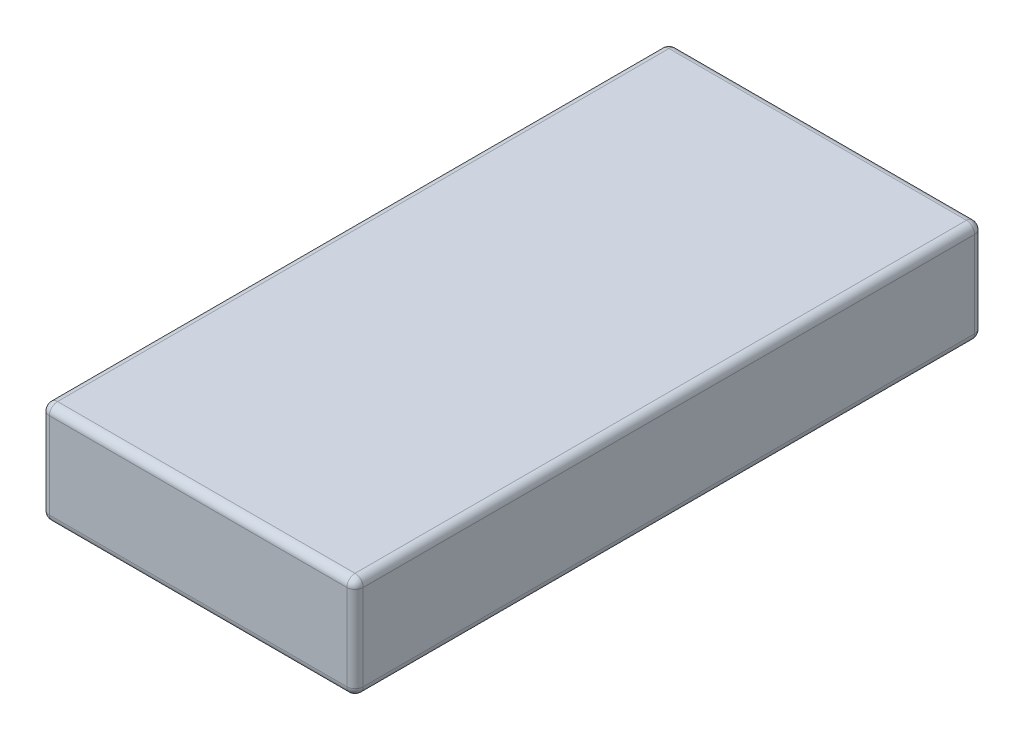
ISO-10303-21;
HEADER;
FILE_DESCRIPTION(('STEP AP214'),'2;1');
FILE_NAME('part.step','',(''),(''),'','','');
FILE_SCHEMA(('AUTOMOTIVE_DESIGN { 1 0 10303 214 1 1 1 1 }'));
ENDSEC;
DATA;
#1=APPLICATION_CONTEXT('core data for automotive mechanical design processes');
#2=APPLICATION_PROTOCOL_DEFINITION('international standard','automotive_design',2000,#1);
#3=PRODUCT_CONTEXT('',#1,'mechanical');
#4=PRODUCT('Part','Part','',(#3));
#5=PRODUCT_RELATED_PRODUCT_CATEGORY('part','',(#4));
#6=PRODUCT_DEFINITION_FORMATION('','',#4);
#7=PRODUCT_DEFINITION_CONTEXT('part definition',#1,'design');
#8=PRODUCT_DEFINITION('design','',#6,#7);
#9=PRODUCT_DEFINITION_SHAPE('','',#8);
#10=(LENGTH_UNIT() NAMED_UNIT(*) SI_UNIT(.MILLI.,.METRE.));
#11=(NAMED_UNIT(*) PLANE_ANGLE_UNIT() SI_UNIT($,.RADIAN.));
#12=(NAMED_UNIT(*) SI_UNIT($,.STERADIAN.) SOLID_ANGLE_UNIT());
#13=UNCERTAINTY_MEASURE_WITH_UNIT(LENGTH_MEASURE(1.E-05),#10,'distance_accuracy_value','');
#14=(GEOMETRIC_REPRESENTATION_CONTEXT(3) GLOBAL_UNCERTAINTY_ASSIGNED_CONTEXT((#13)) GLOBAL_UNIT_ASSIGNED_CONTEXT((#10,
#11,#12)) REPRESENTATION_CONTEXT('',''));
#15=CARTESIAN_POINT('',(0.,0.,0.));
#16=DIRECTION('',(0.,0.,1.));
#17=DIRECTION('',(1.,0.,0.));
#18=AXIS2_PLACEMENT_3D('',#15,#16,#17);
#19=CARTESIAN_POINT('',(57.5,18.75,115.));
#20=DIRECTION('',(-1.,0.,0.));
#21=DIRECTION('',(0.,0.,1.));
#22=AXIS2_PLACEMENT_3D('',#19,#20,#21);
#23=PLANE('',#22);
#24=DIRECTION('',(0.,1.,0.));
#25=VECTOR('',#24,1.);
#26=CARTESIAN_POINT('',(57.5,-18.75,112.));
#27=LINE('',#26,#25);
#28=CARTESIAN_POINT('',(57.5,15.75,112.));
#29=VERTEX_POINT('',#28);
#30=CARTESIAN_POINT('',(57.5,-15.75,112.));
#31=VERTEX_POINT('',#30);
#32=EDGE_CURVE('E221',#29,#31,#27,.F.);
#33=ORIENTED_EDGE('',*,*,#32,.T.);
#34=DIRECTION('',(0.,0.,-1.));
#35=VECTOR('',#34,1.);
#36=CARTESIAN_POINT('',(57.5,-15.75,115.));
#37=LINE('',#36,#35);
#38=CARTESIAN_POINT('',(57.5,-15.75,-112.));
#39=VERTEX_POINT('',#38);
#40=EDGE_CURVE('E224',#31,#39,#37,.T.);
#41=ORIENTED_EDGE('',*,*,#40,.T.);
#42=DIRECTION('',(0.,1.,0.));
#43=VECTOR('',#42,1.);
#44=CARTESIAN_POINT('',(57.5,18.75,-112.));
#45=LINE('',#44,#43);
#46=CARTESIAN_POINT('',(57.5,15.75,-112.));
#47=VERTEX_POINT('',#46);
#48=EDGE_CURVE('E218',#39,#47,#45,.T.);
#49=ORIENTED_EDGE('',*,*,#48,.T.);
#50=DIRECTION('',(0.,0.,-1.));
#51=VECTOR('',#50,1.);
#52=CARTESIAN_POINT('',(57.5,15.75,115.));
#53=LINE('',#52,#51);
#54=EDGE_CURVE('E215',#47,#29,#53,.F.);
#55=ORIENTED_EDGE('',*,*,#54,.T.);
#56=EDGE_LOOP('',(#33,#41,#49,#55));
#57=FACE_BOUND('',#56,.T.);
#58=ADVANCED_FACE('F39',(#57),#23,.F.);
#59=CARTESIAN_POINT('',(-57.5,18.75,115.));
#60=DIRECTION('',(0.,-1.,0.));
#61=DIRECTION('',(0.,0.,-1.));
#62=AXIS2_PLACEMENT_3D('',#59,#60,#61);
#63=PLANE('',#62);
#64=DIRECTION('',(-1.,0.,0.));
#65=VECTOR('',#64,1.);
#66=CARTESIAN_POINT('',(57.5,18.75,112.));
#67=LINE('',#66,#65);
#68=CARTESIAN_POINT('',(-54.5,18.75,112.));
#69=VERTEX_POINT('',#68);
#70=CARTESIAN_POINT('',(54.5,18.75,112.));
#71=VERTEX_POINT('',#70);
#72=EDGE_CURVE('E49',#69,#71,#67,.F.);
#73=ORIENTED_EDGE('',*,*,#72,.T.);
#74=DIRECTION('',(0.,0.,-1.));
#75=VECTOR('',#74,1.);
#76=CARTESIAN_POINT('',(54.5,18.75,115.));
#77=LINE('',#76,#75);
#78=CARTESIAN_POINT('',(54.5,18.75,-112.));
#79=VERTEX_POINT('',#78);
#80=EDGE_CURVE('E11',#71,#79,#77,.T.);
#81=ORIENTED_EDGE('',*,*,#80,.T.);
#82=DIRECTION('',(-1.,0.,0.));
#83=VECTOR('',#82,1.);
#84=CARTESIAN_POINT('',(-57.5,18.75,-112.));
#85=LINE('',#84,#83);
#86=CARTESIAN_POINT('',(-54.5,18.75,-112.));
#87=VERTEX_POINT('',#86);
#88=EDGE_CURVE('E228',#79,#87,#85,.T.);
#89=ORIENTED_EDGE('',*,*,#88,.T.);
#90=DIRECTION('',(0.,0.,-1.));
#91=VECTOR('',#90,1.);
#92=CARTESIAN_POINT('',(-54.5,18.75,115.));
#93=LINE('',#92,#91);
#94=EDGE_CURVE('E60',#87,#69,#93,.F.);
#95=ORIENTED_EDGE('',*,*,#94,.T.);
#96=EDGE_LOOP('',(#73,#81,#89,#95));
#97=FACE_BOUND('',#96,.T.);
#98=ADVANCED_FACE('F346',(#97),#63,.F.);
#99=CARTESIAN_POINT('',(-57.5,18.75,115.));
#100=DIRECTION('',(1.,0.,0.));
#101=DIRECTION('',(0.,1.,0.));
#102=AXIS2_PLACEMENT_3D('',#99,#100,#101);
#103=PLANE('',#102);
#104=DIRECTION('',(0.,0.,-1.));
#105=VECTOR('',#104,1.);
#106=CARTESIAN_POINT('',(-57.5,15.75,115.));
#107=LINE('',#106,#105);
#108=CARTESIAN_POINT('',(-57.5,15.75,112.));
#109=VERTEX_POINT('',#108);
#110=CARTESIAN_POINT('',(-57.5,15.75,-112.));
#111=VERTEX_POINT('',#110);
#112=EDGE_CURVE('E132',#109,#111,#107,.T.);
#113=ORIENTED_EDGE('',*,*,#112,.T.);
#114=DIRECTION('',(0.,-1.,0.));
#115=VECTOR('',#114,1.);
#116=CARTESIAN_POINT('',(-57.5,18.75,-112.));
#117=LINE('',#116,#115);
#118=CARTESIAN_POINT('',(-57.5,-15.75,-112.));
#119=VERTEX_POINT('',#118);
#120=EDGE_CURVE('E174',#111,#119,#117,.T.);
#121=ORIENTED_EDGE('',*,*,#120,.T.);
#122=DIRECTION('',(0.,0.,-1.));
#123=VECTOR('',#122,1.);
#124=CARTESIAN_POINT('',(-57.5,-15.75,115.));
#125=LINE('',#124,#123);
#126=CARTESIAN_POINT('',(-57.5,-15.75,112.));
#127=VERTEX_POINT('',#126);
#128=EDGE_CURVE('E135',#119,#127,#125,.F.);
#129=ORIENTED_EDGE('',*,*,#128,.T.);
#130=DIRECTION('',(0.,-1.,0.));
#131=VECTOR('',#130,1.);
#132=CARTESIAN_POINT('',(-57.5,18.75,112.));
#133=LINE('',#132,#131);
#134=EDGE_CURVE('E127',#127,#109,#133,.F.);
#135=ORIENTED_EDGE('',*,*,#134,.T.);
#136=EDGE_LOOP('',(#113,#121,#129,#135));
#137=FACE_BOUND('',#136,.T.);
#138=ADVANCED_FACE('F129',(#137),#103,.F.);
#139=CARTESIAN_POINT('',(-57.5,-18.75,115.));
#140=DIRECTION('',(0.,1.,0.));
#141=DIRECTION('',(0.,0.,1.));
#142=AXIS2_PLACEMENT_3D('',#139,#140,#141);
#143=PLANE('',#142);
#144=DIRECTION('',(1.,0.,0.));
#145=VECTOR('',#144,1.);
#146=CARTESIAN_POINT('',(-57.5,-18.75,112.));
#147=LINE('',#146,#145);
#148=CARTESIAN_POINT('',(54.5,-18.75,112.));
#149=VERTEX_POINT('',#148);
#150=CARTESIAN_POINT('',(-54.5,-18.75,112.));
#151=VERTEX_POINT('',#150);
#152=EDGE_CURVE('E193',#149,#151,#147,.F.);
#153=ORIENTED_EDGE('',*,*,#152,.T.);
#154=DIRECTION('',(0.,0.,-1.));
#155=VECTOR('',#154,1.);
#156=CARTESIAN_POINT('',(-54.5,-18.75,115.));
#157=LINE('',#156,#155);
#158=CARTESIAN_POINT('',(-54.5,-18.75,-112.));
#159=VERTEX_POINT('',#158);
#160=EDGE_CURVE('E199',#151,#159,#157,.T.);
#161=ORIENTED_EDGE('',*,*,#160,.T.);
#162=DIRECTION('',(1.,0.,0.));
#163=VECTOR('',#162,1.);
#164=CARTESIAN_POINT('',(-57.5,-18.75,-112.));
#165=LINE('',#164,#163);
#166=CARTESIAN_POINT('',(54.5,-18.75,-112.));
#167=VERTEX_POINT('',#166);
#168=EDGE_CURVE('E196',#159,#167,#165,.T.);
#169=ORIENTED_EDGE('',*,*,#168,.T.);
#170=DIRECTION('',(0.,0.,-1.));
#171=VECTOR('',#170,1.);
#172=CARTESIAN_POINT('',(54.5,-18.75,115.));
#173=LINE('',#172,#171);
#174=EDGE_CURVE('E190',#167,#149,#173,.F.);
#175=ORIENTED_EDGE('',*,*,#174,.T.);
#176=EDGE_LOOP('',(#153,#161,#169,#175));
#177=FACE_BOUND('',#176,.T.);
#178=ADVANCED_FACE('F329',(#177),#143,.F.);
#179=CARTESIAN_POINT('',(0.,0.,115.));
#180=DIRECTION('',(0.,0.,1.));
#181=DIRECTION('',(1.,0.,0.));
#182=AXIS2_PLACEMENT_3D('',#179,#180,#181);
#183=PLANE('',#182);
#184=DIRECTION('',(0.,-1.,0.));
#185=VECTOR('',#184,1.);
#186=CARTESIAN_POINT('',(-54.5,-18.75,115.));
#187=LINE('',#186,#185);
#188=CARTESIAN_POINT('',(-54.5,15.75,115.));
#189=VERTEX_POINT('',#188);
#190=CARTESIAN_POINT('',(-54.5,-15.75,115.));
#191=VERTEX_POINT('',#190);
#192=EDGE_CURVE('E146',#189,#191,#187,.T.);
#193=ORIENTED_EDGE('',*,*,#192,.T.);
#194=DIRECTION('',(1.,0.,0.));
#195=VECTOR('',#194,1.);
#196=CARTESIAN_POINT('',(57.5,-15.75,115.));
#197=LINE('',#196,#195);
#198=CARTESIAN_POINT('',(54.5,-15.75,115.));
#199=VERTEX_POINT('',#198);
#200=EDGE_CURVE('E211',#191,#199,#197,.T.);
#201=ORIENTED_EDGE('',*,*,#200,.T.);
#202=DIRECTION('',(0.,1.,0.));
#203=VECTOR('',#202,1.);
#204=CARTESIAN_POINT('',(54.5,18.75,115.));
#205=LINE('',#204,#203);
#206=CARTESIAN_POINT('',(54.5,15.75,115.));
#207=VERTEX_POINT('',#206);
#208=EDGE_CURVE('E206',#199,#207,#205,.T.);
#209=ORIENTED_EDGE('',*,*,#208,.T.);
#210=DIRECTION('',(-1.,0.,0.));
#211=VECTOR('',#210,1.);
#212=CARTESIAN_POINT('',(-57.5,15.75,115.));
#213=LINE('',#212,#211);
#214=EDGE_CURVE('E203',#207,#189,#213,.T.);
#215=ORIENTED_EDGE('',*,*,#214,.T.);
#216=EDGE_LOOP('',(#193,#201,#209,#215));
#217=FACE_BOUND('',#216,.T.);
#218=ADVANCED_FACE('F316',(#217),#183,.T.);
#219=CARTESIAN_POINT('',(0.,0.,-115.));
#220=DIRECTION('',(0.,0.,1.));
#221=DIRECTION('',(1.,0.,0.));
#222=AXIS2_PLACEMENT_3D('',#219,#220,#221);
#223=PLANE('',#222);
#224=DIRECTION('',(1.,0.,0.));
#225=VECTOR('',#224,1.);
#226=CARTESIAN_POINT('',(0.,-15.75,-115.));
#227=LINE('',#226,#225);
#228=CARTESIAN_POINT('',(54.5,-15.75,-115.));
#229=VERTEX_POINT('',#228);
#230=CARTESIAN_POINT('',(-54.5,-15.75,-115.));
#231=VERTEX_POINT('',#230);
#232=EDGE_CURVE('E183',#229,#231,#227,.F.);
#233=ORIENTED_EDGE('',*,*,#232,.T.);
#234=DIRECTION('',(0.,-1.,0.));
#235=VECTOR('',#234,1.);
#236=CARTESIAN_POINT('',(-54.5,0.,-115.));
#237=LINE('',#236,#235);
#238=CARTESIAN_POINT('',(-54.5,15.75,-115.));
#239=VERTEX_POINT('',#238);
#240=EDGE_CURVE('E186',#231,#239,#237,.F.);
#241=ORIENTED_EDGE('',*,*,#240,.T.);
#242=DIRECTION('',(-1.,0.,0.));
#243=VECTOR('',#242,1.);
#244=CARTESIAN_POINT('',(0.,15.75,-115.));
#245=LINE('',#244,#243);
#246=CARTESIAN_POINT('',(54.5,15.75,-115.));
#247=VERTEX_POINT('',#246);
#248=EDGE_CURVE('E177',#239,#247,#245,.F.);
#249=ORIENTED_EDGE('',*,*,#248,.T.);
#250=DIRECTION('',(0.,1.,0.));
#251=VECTOR('',#250,1.);
#252=CARTESIAN_POINT('',(54.5,0.,-115.));
#253=LINE('',#252,#251);
#254=EDGE_CURVE('E180',#247,#229,#253,.F.);
#255=ORIENTED_EDGE('',*,*,#254,.T.);
#256=EDGE_LOOP('',(#233,#241,#249,#255));
#257=FACE_BOUND('',#256,.T.);
#258=ADVANCED_FACE('F532',(#257),#223,.F.);
#259=CARTESIAN_POINT('',(54.5,0.,112.));
#260=DIRECTION('',(0.,-1.,0.));
#261=DIRECTION('',(0.,0.,-1.));
#262=AXIS2_PLACEMENT_3D('',#259,#260,#261);
#263=CYLINDRICAL_SURFACE('',#262,3.);
#264=CARTESIAN_POINT('',(54.5,15.75,112.));
#265=DIRECTION('',(0.,1.,0.));
#266=DIRECTION('',(0.,0.,1.));
#267=AXIS2_PLACEMENT_3D('',#264,#265,#266);
#268=CIRCLE('',#267,3.);
#269=EDGE_CURVE('E43',#207,#29,#268,.T.);
#270=ORIENTED_EDGE('',*,*,#269,.F.);
#271=ORIENTED_EDGE('',*,*,#208,.F.);
#272=CARTESIAN_POINT('',(54.5,-15.75,112.));
#273=DIRECTION('',(0.,-1.,0.));
#274=DIRECTION('',(0.,0.,-1.));
#275=AXIS2_PLACEMENT_3D('',#272,#273,#274);
#276=CIRCLE('',#275,3.);
#277=EDGE_CURVE('E170',#31,#199,#276,.T.);
#278=ORIENTED_EDGE('',*,*,#277,.F.);
#279=ORIENTED_EDGE('',*,*,#32,.F.);
#280=EDGE_LOOP('',(#270,#271,#278,#279));
#281=FACE_BOUND('',#280,.T.);
#282=ADVANCED_FACE('F41',(#281),#263,.T.);
#283=CARTESIAN_POINT('',(54.5,15.75,112.));
#284=DIRECTION('',(0.,0.,1.));
#285=DIRECTION('',(1.,0.,0.));
#286=AXIS2_PLACEMENT_3D('',#283,#284,#285);
#287=SPHERICAL_SURFACE('',#286,3.);
#288=CARTESIAN_POINT('',(54.5,15.75,112.));
#289=DIRECTION('',(1.,0.,0.));
#290=DIRECTION('',(0.,0.,-1.));
#291=AXIS2_PLACEMENT_3D('',#288,#289,#290);
#292=CIRCLE('',#291,3.);
#293=EDGE_CURVE('E294',#207,#71,#292,.F.);
#294=ORIENTED_EDGE('',*,*,#293,.F.);
#295=ORIENTED_EDGE('',*,*,#269,.T.);
#296=CARTESIAN_POINT('',(54.5,15.75,112.));
#297=DIRECTION('',(0.,0.,1.));
#298=DIRECTION('',(1.,0.,0.));
#299=AXIS2_PLACEMENT_3D('',#296,#297,#298);
#300=CIRCLE('',#299,3.);
#301=EDGE_CURVE('E297',#71,#29,#300,.F.);
#302=ORIENTED_EDGE('',*,*,#301,.F.);
#303=EDGE_LOOP('',(#294,#295,#302));
#304=FACE_BOUND('',#303,.T.);
#305=ADVANCED_FACE('F339',(#304),#287,.T.);
#306=CARTESIAN_POINT('',(54.5,-15.75,112.));
#307=DIRECTION('',(0.,0.,1.));
#308=DIRECTION('',(1.,0.,0.));
#309=AXIS2_PLACEMENT_3D('',#306,#307,#308);
#310=SPHERICAL_SURFACE('',#309,3.);
#311=CARTESIAN_POINT('',(54.5,-15.75,112.));
#312=DIRECTION('',(0.,0.,1.));
#313=DIRECTION('',(1.,0.,0.));
#314=AXIS2_PLACEMENT_3D('',#311,#312,#313);
#315=CIRCLE('',#314,3.);
#316=EDGE_CURVE('E287',#31,#149,#315,.F.);
#317=ORIENTED_EDGE('',*,*,#316,.F.);
#318=ORIENTED_EDGE('',*,*,#277,.T.);
#319=CARTESIAN_POINT('',(54.5,-15.75,112.));
#320=DIRECTION('',(1.,0.,0.));
#321=DIRECTION('',(0.,0.,-1.));
#322=AXIS2_PLACEMENT_3D('',#319,#320,#321);
#323=CIRCLE('',#322,3.);
#324=EDGE_CURVE('E291',#149,#199,#323,.F.);
#325=ORIENTED_EDGE('',*,*,#324,.F.);
#326=EDGE_LOOP('',(#317,#318,#325));
#327=FACE_BOUND('',#326,.T.);
#328=ADVANCED_FACE('F307',(#327),#310,.T.);
#329=CARTESIAN_POINT('',(54.5,15.75,115.));
#330=DIRECTION('',(0.,0.,-1.));
#331=DIRECTION('',(-1.,0.,0.));
#332=AXIS2_PLACEMENT_3D('',#329,#330,#331);
#333=CYLINDRICAL_SURFACE('',#332,3.);
#334=ORIENTED_EDGE('',*,*,#301,.T.);
#335=ORIENTED_EDGE('',*,*,#54,.F.);
#336=CARTESIAN_POINT('',(54.5,15.75,-112.));
#337=DIRECTION('',(0.,0.,-1.));
#338=DIRECTION('',(-1.,0.,0.));
#339=AXIS2_PLACEMENT_3D('',#336,#337,#338);
#340=CIRCLE('',#339,3.);
#341=EDGE_CURVE('E279',#79,#47,#340,.T.);
#342=ORIENTED_EDGE('',*,*,#341,.F.);
#343=ORIENTED_EDGE('',*,*,#80,.F.);
#344=EDGE_LOOP('',(#334,#335,#342,#343));
#345=FACE_BOUND('',#344,.T.);
#346=ADVANCED_FACE('F343',(#345),#333,.T.);
#347=CARTESIAN_POINT('',(0.,15.75,112.));
#348=DIRECTION('',(1.,0.,0.));
#349=DIRECTION('',(0.,0.,-1.));
#350=AXIS2_PLACEMENT_3D('',#347,#348,#349);
#351=CYLINDRICAL_SURFACE('',#350,3.);
#352=ORIENTED_EDGE('',*,*,#293,.T.);
#353=ORIENTED_EDGE('',*,*,#72,.F.);
#354=CARTESIAN_POINT('',(-54.5,15.75,112.));
#355=DIRECTION('',(-1.,0.,0.));
#356=DIRECTION('',(0.,0.,1.));
#357=AXIS2_PLACEMENT_3D('',#354,#355,#356);
#358=CIRCLE('',#357,3.);
#359=EDGE_CURVE('E151',#189,#69,#358,.T.);
#360=ORIENTED_EDGE('',*,*,#359,.F.);
#361=ORIENTED_EDGE('',*,*,#214,.F.);
#362=EDGE_LOOP('',(#352,#353,#360,#361));
#363=FACE_BOUND('',#362,.T.);
#364=ADVANCED_FACE('F496',(#363),#351,.T.);
#365=CARTESIAN_POINT('',(-54.5,0.,112.));
#366=DIRECTION('',(0.,1.,0.));
#367=DIRECTION('',(-1.,0.,0.));
#368=AXIS2_PLACEMENT_3D('',#365,#366,#367);
#369=CYLINDRICAL_SURFACE('',#368,3.);
#370=CARTESIAN_POINT('',(-54.5,-15.75,112.));
#371=DIRECTION('',(0.,-1.,0.));
#372=DIRECTION('',(0.,0.,-1.));
#373=AXIS2_PLACEMENT_3D('',#370,#371,#372);
#374=CIRCLE('',#373,3.);
#375=EDGE_CURVE('E152',#191,#127,#374,.T.);
#376=ORIENTED_EDGE('',*,*,#375,.F.);
#377=ORIENTED_EDGE('',*,*,#192,.F.);
#378=CARTESIAN_POINT('',(-54.5,15.75,112.));
#379=DIRECTION('',(0.,1.,0.));
#380=DIRECTION('',(0.,0.,1.));
#381=AXIS2_PLACEMENT_3D('',#378,#379,#380);
#382=CIRCLE('',#381,3.);
#383=EDGE_CURVE('E143',#109,#189,#382,.T.);
#384=ORIENTED_EDGE('',*,*,#383,.F.);
#385=ORIENTED_EDGE('',*,*,#134,.F.);
#386=EDGE_LOOP('',(#376,#377,#384,#385));
#387=FACE_BOUND('',#386,.T.);
#388=ADVANCED_FACE('F145',(#387),#369,.T.);
#389=CARTESIAN_POINT('',(0.,-15.75,112.));
#390=DIRECTION('',(-1.,0.,0.));
#391=DIRECTION('',(0.,0.,1.));
#392=AXIS2_PLACEMENT_3D('',#389,#390,#391);
#393=CYLINDRICAL_SURFACE('',#392,3.);
#394=ORIENTED_EDGE('',*,*,#324,.T.);
#395=ORIENTED_EDGE('',*,*,#200,.F.);
#396=CARTESIAN_POINT('',(-54.5,-15.75,112.));
#397=DIRECTION('',(-1.,0.,0.));
#398=DIRECTION('',(0.,0.,1.));
#399=AXIS2_PLACEMENT_3D('',#396,#397,#398);
#400=CIRCLE('',#399,3.);
#401=EDGE_CURVE('E271',#151,#191,#400,.T.);
#402=ORIENTED_EDGE('',*,*,#401,.F.);
#403=ORIENTED_EDGE('',*,*,#152,.F.);
#404=EDGE_LOOP('',(#394,#395,#402,#403));
#405=FACE_BOUND('',#404,.T.);
#406=ADVANCED_FACE('F319',(#405),#393,.T.);
#407=CARTESIAN_POINT('',(54.5,-15.75,115.));
#408=DIRECTION('',(0.,0.,-1.));
#409=DIRECTION('',(-1.,0.,0.));
#410=AXIS2_PLACEMENT_3D('',#407,#408,#409);
#411=CYLINDRICAL_SURFACE('',#410,3.);
#412=ORIENTED_EDGE('',*,*,#316,.T.);
#413=ORIENTED_EDGE('',*,*,#174,.F.);
#414=CARTESIAN_POINT('',(54.5,-15.75,-112.));
#415=DIRECTION('',(0.,0.,-1.));
#416=DIRECTION('',(-1.,0.,0.));
#417=AXIS2_PLACEMENT_3D('',#414,#415,#416);
#418=CIRCLE('',#417,3.);
#419=EDGE_CURVE('E267',#39,#167,#418,.T.);
#420=ORIENTED_EDGE('',*,*,#419,.F.);
#421=ORIENTED_EDGE('',*,*,#40,.F.);
#422=EDGE_LOOP('',(#412,#413,#420,#421));
#423=FACE_BOUND('',#422,.T.);
#424=ADVANCED_FACE('F333',(#423),#411,.T.);
#425=CARTESIAN_POINT('',(54.5,18.75,-112.));
#426=DIRECTION('',(0.,1.,0.));
#427=DIRECTION('',(0.,0.,1.));
#428=AXIS2_PLACEMENT_3D('',#425,#426,#427);
#429=CYLINDRICAL_SURFACE('',#428,3.);
#430=CARTESIAN_POINT('',(54.5,15.75,-112.));
#431=DIRECTION('',(0.,1.,0.));
#432=DIRECTION('',(0.,0.,1.));
#433=AXIS2_PLACEMENT_3D('',#430,#431,#432);
#434=CIRCLE('',#433,3.);
#435=EDGE_CURVE('E283',#47,#247,#434,.T.);
#436=ORIENTED_EDGE('',*,*,#435,.F.);
#437=ORIENTED_EDGE('',*,*,#48,.F.);
#438=CARTESIAN_POINT('',(54.5,-15.75,-112.));
#439=DIRECTION('',(0.,-1.,0.));
#440=DIRECTION('',(1.,0.,0.));
#441=AXIS2_PLACEMENT_3D('',#438,#439,#440);
#442=CIRCLE('',#441,3.);
#443=EDGE_CURVE('E264',#229,#39,#442,.T.);
#444=ORIENTED_EDGE('',*,*,#443,.F.);
#445=ORIENTED_EDGE('',*,*,#254,.F.);
#446=EDGE_LOOP('',(#436,#437,#444,#445));
#447=FACE_BOUND('',#446,.T.);
#448=ADVANCED_FACE('F371',(#447),#429,.T.);
#449=CARTESIAN_POINT('',(54.5,15.75,-112.));
#450=DIRECTION('',(0.,0.,1.));
#451=DIRECTION('',(1.,0.,0.));
#452=AXIS2_PLACEMENT_3D('',#449,#450,#451);
#453=SPHERICAL_SURFACE('',#452,3.);
#454=ORIENTED_EDGE('',*,*,#341,.T.);
#455=ORIENTED_EDGE('',*,*,#435,.T.);
#456=CARTESIAN_POINT('',(54.5,15.75,-112.));
#457=DIRECTION('',(1.,0.,0.));
#458=DIRECTION('',(0.,0.,-1.));
#459=AXIS2_PLACEMENT_3D('',#456,#457,#458);
#460=CIRCLE('',#459,3.);
#461=EDGE_CURVE('E159',#79,#247,#460,.F.);
#462=ORIENTED_EDGE('',*,*,#461,.F.);
#463=EDGE_LOOP('',(#454,#455,#462));
#464=FACE_BOUND('',#463,.T.);
#465=ADVANCED_FACE('F373',(#464),#453,.T.);
#466=CARTESIAN_POINT('',(-54.5,15.75,112.));
#467=DIRECTION('',(0.,0.,1.));
#468=DIRECTION('',(1.,0.,0.));
#469=AXIS2_PLACEMENT_3D('',#466,#467,#468);
#470=SPHERICAL_SURFACE('',#469,3.);
#471=ORIENTED_EDGE('',*,*,#383,.T.);
#472=ORIENTED_EDGE('',*,*,#359,.T.);
#473=CARTESIAN_POINT('',(-54.5,15.75,112.));
#474=DIRECTION('',(0.,0.,1.));
#475=DIRECTION('',(1.,0.,0.));
#476=AXIS2_PLACEMENT_3D('',#473,#474,#475);
#477=CIRCLE('',#476,3.);
#478=EDGE_CURVE('E155',#109,#69,#477,.F.);
#479=ORIENTED_EDGE('',*,*,#478,.F.);
#480=EDGE_LOOP('',(#471,#472,#479));
#481=FACE_BOUND('',#480,.T.);
#482=ADVANCED_FACE('F156',(#481),#470,.T.);
#483=CARTESIAN_POINT('',(-54.5,-15.75,112.));
#484=DIRECTION('',(0.,0.,1.));
#485=DIRECTION('',(1.,0.,0.));
#486=AXIS2_PLACEMENT_3D('',#483,#484,#485);
#487=SPHERICAL_SURFACE('',#486,3.);
#488=ORIENTED_EDGE('',*,*,#401,.T.);
#489=ORIENTED_EDGE('',*,*,#375,.T.);
#490=CARTESIAN_POINT('',(-54.5,-15.75,112.));
#491=DIRECTION('',(0.,0.,1.));
#492=DIRECTION('',(1.,0.,0.));
#493=AXIS2_PLACEMENT_3D('',#490,#491,#492);
#494=CIRCLE('',#493,3.);
#495=EDGE_CURVE('E160',#151,#127,#494,.F.);
#496=ORIENTED_EDGE('',*,*,#495,.F.);
#497=EDGE_LOOP('',(#488,#489,#496));
#498=FACE_BOUND('',#497,.T.);
#499=ADVANCED_FACE('F322',(#498),#487,.T.);
#500=CARTESIAN_POINT('',(54.5,-15.75,-112.));
#501=DIRECTION('',(0.,0.,1.));
#502=DIRECTION('',(1.,0.,0.));
#503=AXIS2_PLACEMENT_3D('',#500,#501,#502);
#504=SPHERICAL_SURFACE('',#503,3.);
#505=ORIENTED_EDGE('',*,*,#443,.T.);
#506=ORIENTED_EDGE('',*,*,#419,.T.);
#507=CARTESIAN_POINT('',(54.5,-15.75,-112.));
#508=DIRECTION('',(1.,0.,0.));
#509=DIRECTION('',(0.,0.,-1.));
#510=AXIS2_PLACEMENT_3D('',#507,#508,#509);
#511=CIRCLE('',#510,3.);
#512=EDGE_CURVE('E254',#229,#167,#511,.F.);
#513=ORIENTED_EDGE('',*,*,#512,.F.);
#514=EDGE_LOOP('',(#505,#506,#513));
#515=FACE_BOUND('',#514,.T.);
#516=ADVANCED_FACE('F367',(#515),#504,.T.);
#517=CARTESIAN_POINT('',(-57.5,15.75,-112.));
#518=DIRECTION('',(-1.,0.,0.));
#519=DIRECTION('',(0.,0.,1.));
#520=AXIS2_PLACEMENT_3D('',#517,#518,#519);
#521=CYLINDRICAL_SURFACE('',#520,3.);
#522=ORIENTED_EDGE('',*,*,#461,.T.);
#523=ORIENTED_EDGE('',*,*,#248,.F.);
#524=CARTESIAN_POINT('',(-54.5,15.75,-112.));
#525=DIRECTION('',(-1.,0.,0.));
#526=DIRECTION('',(0.,0.,1.));
#527=AXIS2_PLACEMENT_3D('',#524,#525,#526);
#528=CIRCLE('',#527,3.);
#529=EDGE_CURVE('E250',#87,#239,#528,.T.);
#530=ORIENTED_EDGE('',*,*,#529,.F.);
#531=ORIENTED_EDGE('',*,*,#88,.F.);
#532=EDGE_LOOP('',(#522,#523,#530,#531));
#533=FACE_BOUND('',#532,.T.);
#534=ADVANCED_FACE('F351',(#533),#521,.T.);
#535=CARTESIAN_POINT('',(-54.5,15.75,115.));
#536=DIRECTION('',(0.,0.,-1.));
#537=DIRECTION('',(-1.,0.,0.));
#538=AXIS2_PLACEMENT_3D('',#535,#536,#537);
#539=CYLINDRICAL_SURFACE('',#538,3.);
#540=ORIENTED_EDGE('',*,*,#478,.T.);
#541=ORIENTED_EDGE('',*,*,#94,.F.);
#542=CARTESIAN_POINT('',(-54.5,15.75,-112.));
#543=DIRECTION('',(0.,0.,-1.));
#544=DIRECTION('',(-1.,0.,0.));
#545=AXIS2_PLACEMENT_3D('',#542,#543,#544);
#546=CIRCLE('',#545,3.);
#547=EDGE_CURVE('E164',#111,#87,#546,.T.);
#548=ORIENTED_EDGE('',*,*,#547,.F.);
#549=ORIENTED_EDGE('',*,*,#112,.F.);
#550=EDGE_LOOP('',(#540,#541,#548,#549));
#551=FACE_BOUND('',#550,.T.);
#552=ADVANCED_FACE('F162',(#551),#539,.T.);
#553=CARTESIAN_POINT('',(-54.5,-15.75,115.));
#554=DIRECTION('',(0.,0.,-1.));
#555=DIRECTION('',(-1.,0.,0.));
#556=AXIS2_PLACEMENT_3D('',#553,#554,#555);
#557=CYLINDRICAL_SURFACE('',#556,3.);
#558=ORIENTED_EDGE('',*,*,#495,.T.);
#559=ORIENTED_EDGE('',*,*,#128,.F.);
#560=CARTESIAN_POINT('',(-54.5,-15.75,-112.));
#561=DIRECTION('',(0.,0.,-1.));
#562=DIRECTION('',(-1.,0.,0.));
#563=AXIS2_PLACEMENT_3D('',#560,#561,#562);
#564=CIRCLE('',#563,3.);
#565=EDGE_CURVE('E244',#159,#119,#564,.T.);
#566=ORIENTED_EDGE('',*,*,#565,.F.);
#567=ORIENTED_EDGE('',*,*,#160,.F.);
#568=EDGE_LOOP('',(#558,#559,#566,#567));
#569=FACE_BOUND('',#568,.T.);
#570=ADVANCED_FACE('F326',(#569),#557,.T.);
#571=CARTESIAN_POINT('',(-57.5,-15.75,-112.));
#572=DIRECTION('',(1.,0.,0.));
#573=DIRECTION('',(0.,0.,-1.));
#574=AXIS2_PLACEMENT_3D('',#571,#572,#573);
#575=CYLINDRICAL_SURFACE('',#574,3.);
#576=ORIENTED_EDGE('',*,*,#512,.T.);
#577=ORIENTED_EDGE('',*,*,#168,.F.);
#578=CARTESIAN_POINT('',(-54.5,-15.75,-112.));
#579=DIRECTION('',(-1.,0.,0.));
#580=DIRECTION('',(0.,0.,1.));
#581=AXIS2_PLACEMENT_3D('',#578,#579,#580);
#582=CIRCLE('',#581,3.);
#583=EDGE_CURVE('E241',#231,#159,#582,.T.);
#584=ORIENTED_EDGE('',*,*,#583,.F.);
#585=ORIENTED_EDGE('',*,*,#232,.F.);
#586=EDGE_LOOP('',(#576,#577,#584,#585));
#587=FACE_BOUND('',#586,.T.);
#588=ADVANCED_FACE('F364',(#587),#575,.T.);
#589=CARTESIAN_POINT('',(-54.5,15.75,-112.));
#590=DIRECTION('',(0.,0.,1.));
#591=DIRECTION('',(1.,0.,0.));
#592=AXIS2_PLACEMENT_3D('',#589,#590,#591);
#593=SPHERICAL_SURFACE('',#592,3.);
#594=ORIENTED_EDGE('',*,*,#547,.T.);
#595=ORIENTED_EDGE('',*,*,#529,.T.);
#596=CARTESIAN_POINT('',(-54.5,15.75,-112.));
#597=DIRECTION('',(0.,1.,0.));
#598=DIRECTION('',(0.,0.,1.));
#599=AXIS2_PLACEMENT_3D('',#596,#597,#598);
#600=CIRCLE('',#599,3.);
#601=EDGE_CURVE('E238',#111,#239,#600,.F.);
#602=ORIENTED_EDGE('',*,*,#601,.F.);
#603=EDGE_LOOP('',(#594,#595,#602));
#604=FACE_BOUND('',#603,.T.);
#605=ADVANCED_FACE('F353',(#604),#593,.T.);
#606=CARTESIAN_POINT('',(-54.5,-15.75,-112.));
#607=DIRECTION('',(0.,0.,1.));
#608=DIRECTION('',(1.,0.,0.));
#609=AXIS2_PLACEMENT_3D('',#606,#607,#608);
#610=SPHERICAL_SURFACE('',#609,3.);
#611=ORIENTED_EDGE('',*,*,#583,.T.);
#612=ORIENTED_EDGE('',*,*,#565,.T.);
#613=CARTESIAN_POINT('',(-54.5,-15.75,-112.));
#614=DIRECTION('',(0.,-1.,0.));
#615=DIRECTION('',(0.,0.,-1.));
#616=AXIS2_PLACEMENT_3D('',#613,#614,#615);
#617=CIRCLE('',#616,3.);
#618=EDGE_CURVE('E235',#231,#119,#617,.F.);
#619=ORIENTED_EDGE('',*,*,#618,.F.);
#620=EDGE_LOOP('',(#611,#612,#619));
#621=FACE_BOUND('',#620,.T.);
#622=ADVANCED_FACE('F360',(#621),#610,.T.);
#623=CARTESIAN_POINT('',(-54.5,18.75,-112.));
#624=DIRECTION('',(0.,-1.,0.));
#625=DIRECTION('',(1.,0.,0.));
#626=AXIS2_PLACEMENT_3D('',#623,#624,#625);
#627=CYLINDRICAL_SURFACE('',#626,3.);
#628=ORIENTED_EDGE('',*,*,#601,.T.);
#629=ORIENTED_EDGE('',*,*,#240,.F.);
#630=ORIENTED_EDGE('',*,*,#618,.T.);
#631=ORIENTED_EDGE('',*,*,#120,.F.);
#632=EDGE_LOOP('',(#628,#629,#630,#631));
#633=FACE_BOUND('',#632,.T.);
#634=ADVANCED_FACE('F357',(#633),#627,.T.);
#635=CLOSED_SHELL('',(#58,#98,#138,#178,#218,#258,#282,#305,#328,#346,#364,#388,#406,#424,#448,
#465,#482,#499,#516,#534,#552,#570,#588,#605,#622,#634));
#636=MANIFOLD_SOLID_BREP('B2',#635);
#637=ADVANCED_BREP_SHAPE_REPRESENTATION('',(#18,#636),#14);
#638=SHAPE_DEFINITION_REPRESENTATION(#9,#637);
ENDSEC;
END-ISO-10303-21;
